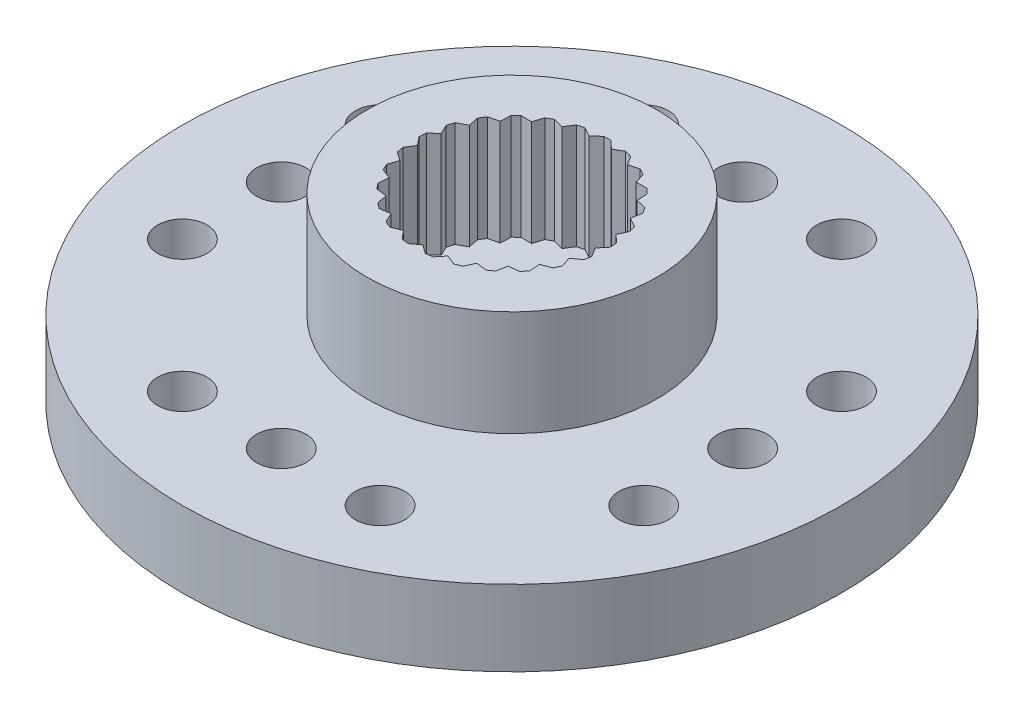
from build123d import *

# Parameters (mm, degrees)
SKETCH2_R           = 6
SKETCH2_R_2         = 1.5
BOSS_EXTRUDE1_DEPTH = 1.15
SKETCH3_R           = 4.4
BOSS_EXTRUDE2_DEPTH = 3.2
SKETCH5_R           = 10
SKETCH5_R_2         = 0.75
SKETCH5_R_3         = 1.5
BOSS_EXTRUDE4_DEPTH = 1.15


with BuildPart() as part:
    # Sketch2 → Boss-Extrude1 (new, symmetric)
    with BuildSketch(Plane(origin=(0, 0, 0), x_dir=(1, 0, 0), z_dir=(0, 1, 0))):
        with Locations(Location((0, 0, 0), (0, 0, 270))):
            Circle(SKETCH2_R)
        with Locations(Location((0, 0, 0), (0, 0, 270))):
            Circle(SKETCH2_R_2, mode=Mode.SUBTRACT)
    extrude(amount=BOSS_EXTRUDE1_DEPTH, both=True)

    # Sketch3 → Boss-Extrude2 (add)
    with BuildSketch(Plane(origin=(0, 1.15, 0), x_dir=(1, 0, 0), z_dir=(0, 1, 0))):
        with Locations(Location((0, 0, 0), (0, 0, 270))):
            Circle(SKETCH3_R)
        with BuildLine():
            Line((0.107421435, 2.898009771), (0.338399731, 2.678709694))
            Line((0.338399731, 2.678709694), (0.61665913, 2.83367809))
            ThreePointArc((0.61665913, 2.83367809), (0.721200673, 2.808891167), (0.824752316, 2.780248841))
            Line((0.824752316, 2.780248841), (0.993936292, 2.510396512))
            Line((0.993936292, 2.510396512), (1.301992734, 2.591295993))
            ThreePointArc((1.301992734, 2.591295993), (1.397085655, 2.541289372), (1.490260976, 2.48779465))
            Line((1.490260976, 2.48779465), (1.587020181, 2.184345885))
            Line((1.587020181, 2.184345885), (1.905517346, 2.186093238))
            ThreePointArc((1.905517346, 2.186093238), (1.985186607, 2.11400902), (2.062131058, 2.039023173))
            Line((2.062131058, 2.039023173), (2.080385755, 1.721044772))
            Line((2.080385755, 1.721044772), (2.389311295, 1.643530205))
            ThreePointArc((2.389311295, 1.643530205), (2.448550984, 1.553897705), (2.504429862, 1.46213237))
            Line((2.504429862, 1.46213237), (2.443033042, 1.149604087))
            Line((2.443033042, 1.149604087), (2.722976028, 0.997698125))
            ThreePointArc((2.722976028, 0.997698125), (2.758063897, 0.896149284), (2.789366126, 0.793370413))
            Line((2.789366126, 0.793370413), (2.652175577, 0.505929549))
            Line((2.652175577, 0.505929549), (2.885546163, 0.289177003))
            ThreePointArc((2.885546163, 0.289177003), (2.894277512, 0.182092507), (2.899036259, 0.074758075))
            Line((2.899036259, 0.074758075), (2.694672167, -0.169534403))
            Line((2.694672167, -0.169534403), (2.866806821, -0.437514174))
            ThreePointArc((2.866806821, -0.437514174), (2.848633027, -0.543405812), (2.826549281, -0.648551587))
            Line((2.826549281, -0.648551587), (2.567852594, -0.834345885))
            Line((2.567852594, -0.834345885), (2.667935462, -1.136714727))
            ThreePointArc((2.667935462, -1.136714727), (2.623998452, -1.234759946), (2.576459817, -1.331110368))
            Line((2.576459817, -1.331110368), (2.279685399, -1.446732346))
            Line((2.279685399, -1.446732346), (2.301427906, -1.764491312))
            ThreePointArc((2.301427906, -1.764491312), (2.234488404, -1.84852957), (2.164481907, -1.930030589))
            Line((2.164481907, -1.930030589), (1.848277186, -1.968215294))
            Line((1.848277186, -1.968215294), (1.790313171, -2.281398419))
            ThreePointArc((1.790313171, -2.281398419), (1.704577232, -2.346149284), (1.616501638, -2.40767989))
            Line((1.616501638, -2.40767989), (1.30073492, -2.366028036))
            Line((1.30073492, -2.366028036), (1.166706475, -2.654956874))
            ThreePointArc((1.166706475, -2.654956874), (1.067561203, -2.696351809), (0.966950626, -2.734045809))
            Line((0.966950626, -2.734045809), (0.671462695, -2.615174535))
            Line((0.671462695, -2.615174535), (0.469791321, -2.861694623))
            ThreePointArc((0.469791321, -2.861694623), (0.363466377, -2.877132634), (0.25664255, -2.888621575))
            Line((0.25664255, -2.888621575), (0, -2.7))
            Line((0, -2.7), (-0.25664255, -2.888621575))
            ThreePointArc((-0.25664255, -2.888621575), (-0.363466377, -2.877132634), (-0.469791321, -2.861694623))
            Line((-0.469791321, -2.861694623), (-0.671462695, -2.615174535))
            Line((-0.671462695, -2.615174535), (-0.966950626, -2.734045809))
            ThreePointArc((-0.966950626, -2.734045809), (-1.067561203, -2.696351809), (-1.166706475, -2.654956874))
            Line((-1.166706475, -2.654956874), (-1.30073492, -2.366028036))
            Line((-1.30073492, -2.366028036), (-1.616501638, -2.40767989))
            ThreePointArc((-1.616501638, -2.40767989), (-1.704577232, -2.346149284), (-1.790313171, -2.281398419))
            Line((-1.790313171, -2.281398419), (-1.848277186, -1.968215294))
            Line((-1.848277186, -1.968215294), (-2.164481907, -1.930030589))
            ThreePointArc((-2.164481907, -1.930030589), (-2.234488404, -1.84852957), (-2.301427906, -1.764491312))
            Line((-2.301427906, -1.764491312), (-2.279685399, -1.446732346))
            Line((-2.279685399, -1.446732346), (-2.576459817, -1.331110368))
            ThreePointArc((-2.576459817, -1.331110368), (-2.623998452, -1.234759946), (-2.667935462, -1.136714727))
            Line((-2.667935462, -1.136714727), (-2.567852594, -0.834345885))
            Line((-2.567852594, -0.834345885), (-2.826549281, -0.648551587))
            ThreePointArc((-2.826549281, -0.648551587), (-2.848633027, -0.543405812), (-2.866806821, -0.437514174))
            Line((-2.866806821, -0.437514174), (-2.694672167, -0.169534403))
            Line((-2.694672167, -0.169534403), (-2.899036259, 0.074758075))
            ThreePointArc((-2.899036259, 0.074758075), (-2.894277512, 0.182092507), (-2.885546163, 0.289177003))
            Line((-2.885546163, 0.289177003), (-2.652175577, 0.505929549))
            Line((-2.652175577, 0.505929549), (-2.789366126, 0.793370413))
            ThreePointArc((-2.789366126, 0.793370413), (-2.758063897, 0.896149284), (-2.722976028, 0.997698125))
            Line((-2.722976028, 0.997698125), (-2.443033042, 1.149604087))
            Line((-2.443033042, 1.149604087), (-2.504429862, 1.46213237))
            ThreePointArc((-2.504429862, 1.46213237), (-2.448550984, 1.553897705), (-2.389311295, 1.643530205))
            Line((-2.389311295, 1.643530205), (-2.080385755, 1.721044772))
            Line((-2.080385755, 1.721044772), (-2.062131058, 2.039023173))
            ThreePointArc((-2.062131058, 2.039023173), (-1.985186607, 2.11400902), (-1.905517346, 2.186093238))
            Line((-1.905517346, 2.186093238), (-1.587020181, 2.184345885))
            Line((-1.587020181, 2.184345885), (-1.490260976, 2.48779465))
            ThreePointArc((-1.490260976, 2.48779465), (-1.397085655, 2.541289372), (-1.301992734, 2.591295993))
            Line((-1.301992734, 2.591295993), (-0.993936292, 2.510396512))
            Line((-0.993936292, 2.510396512), (-0.824752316, 2.780248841))
            ThreePointArc((-0.824752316, 2.780248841), (-0.721200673, 2.808891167), (-0.61665913, 2.83367809))
            Line((-0.61665913, 2.83367809), (-0.338399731, 2.678709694))
            Line((-0.338399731, 2.678709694), (-0.107421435, 2.898009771))
            ThreePointArc((-0.107421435, 2.898009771), (0, 2.9), (0.107421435, 2.898009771))
        make_face(mode=Mode.SUBTRACT)
    extrude(amount=BOSS_EXTRUDE2_DEPTH)

    # Sketch5 → Boss-Extrude4 (add, symmetric)
    with BuildSketch(Plane(origin=(0, 0, 0), x_dir=(1, 0, 0), z_dir=(0, 1, 0))):
        with Locations(Location((0, 0, 0), (0, 0, 270))):
            Circle(SKETCH5_R)
        with Locations(Location((0, 7, 0), (0, 0, 270))):
            Circle(SKETCH5_R_2, mode=Mode.SUBTRACT)
        with Locations(Location((-3, 7, 0), (0, 0, 270))):
            Circle(SKETCH5_R_2, mode=Mode.SUBTRACT)
        with Locations(Location((3, 7, 0), (0, 0, 270))):
            Circle(SKETCH5_R_2, mode=Mode.SUBTRACT)
        with Locations(Location((7, 3, 0), (0, 0, 270))):
            Circle(SKETCH5_R_2, mode=Mode.SUBTRACT)
        with Locations(Location((7, 0, 0), (0, 0, 270))):
            Circle(SKETCH5_R_2, mode=Mode.SUBTRACT)
        with Locations(Location((7, -3, 0), (0, 0, 270))):
            Circle(SKETCH5_R_2, mode=Mode.SUBTRACT)
        with Locations(Location((3, -7, 0), (0, 0, 270))):
            Circle(SKETCH5_R_2, mode=Mode.SUBTRACT)
        with Locations(Location((0, -7, 0), (0, 0, 270))):
            Circle(SKETCH5_R_2, mode=Mode.SUBTRACT)
        with Locations(Location((-3, -7, 0), (0, 0, 270))):
            Circle(SKETCH5_R_2, mode=Mode.SUBTRACT)
        with Locations(Location((-7, -3, 0), (0, 0, 270))):
            Circle(SKETCH5_R_2, mode=Mode.SUBTRACT)
        with Locations(Location((-7, 0, 0), (0, 0, 270))):
            Circle(SKETCH5_R_2, mode=Mode.SUBTRACT)
        with Locations(Location((-7, 3, 0), (0, 0, 270))):
            Circle(SKETCH5_R_2, mode=Mode.SUBTRACT)
        with Locations(Location((0, 0, 0), (0, 0, 270))):
            Circle(SKETCH5_R_3, mode=Mode.SUBTRACT)
    extrude(amount=BOSS_EXTRUDE4_DEPTH, both=True)


solid = part.part
